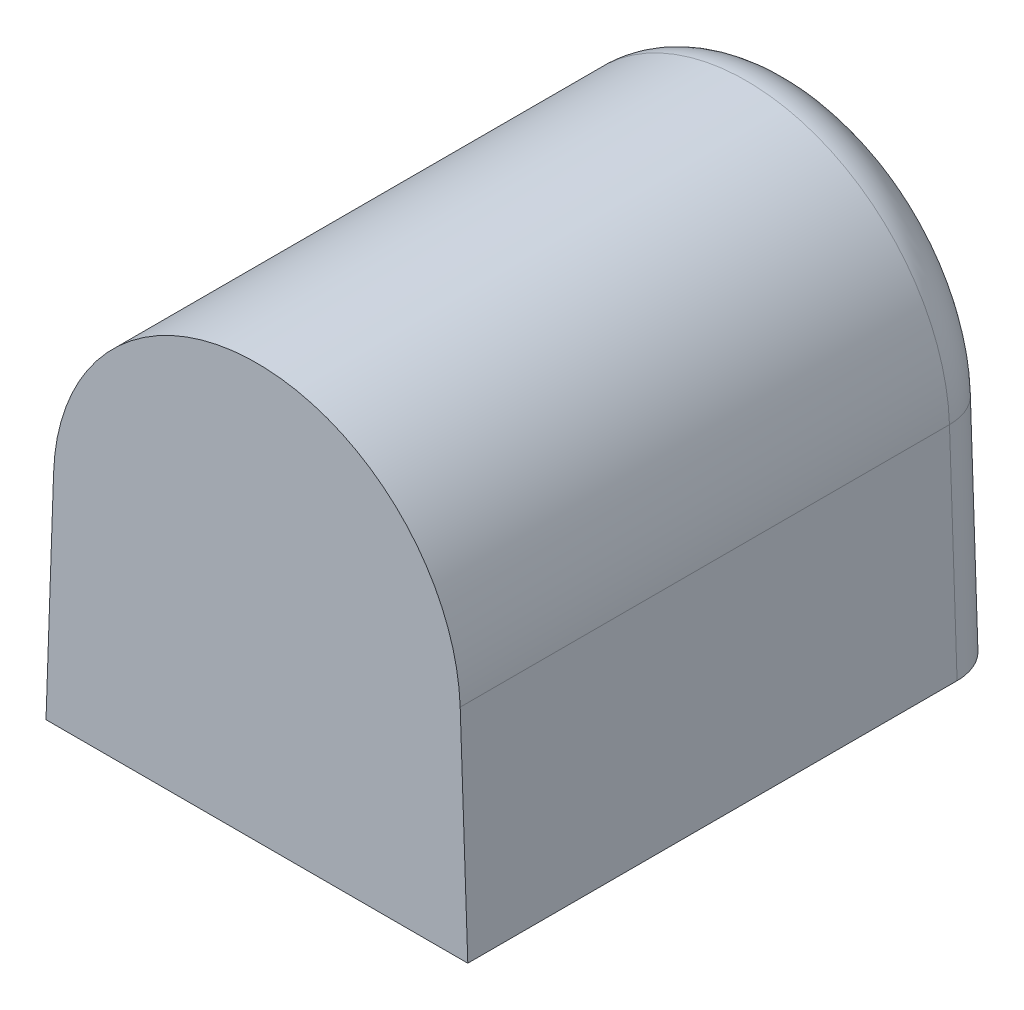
ISO-10303-21;
HEADER;
FILE_DESCRIPTION(('STEP AP214'),'2;1');
FILE_NAME('part.step','',(''),(''),'','','');
FILE_SCHEMA(('AUTOMOTIVE_DESIGN { 1 0 10303 214 1 1 1 1 }'));
ENDSEC;
DATA;
#1=APPLICATION_CONTEXT('core data for automotive mechanical design processes');
#2=APPLICATION_PROTOCOL_DEFINITION('international standard','automotive_design',2000,#1);
#3=PRODUCT_CONTEXT('',#1,'mechanical');
#4=PRODUCT('Part','Part','',(#3));
#5=PRODUCT_RELATED_PRODUCT_CATEGORY('part','',(#4));
#6=PRODUCT_DEFINITION_FORMATION('','',#4);
#7=PRODUCT_DEFINITION_CONTEXT('part definition',#1,'design');
#8=PRODUCT_DEFINITION('design','',#6,#7);
#9=PRODUCT_DEFINITION_SHAPE('','',#8);
#10=(LENGTH_UNIT() NAMED_UNIT(*) SI_UNIT(.MILLI.,.METRE.));
#11=(NAMED_UNIT(*) PLANE_ANGLE_UNIT() SI_UNIT($,.RADIAN.));
#12=(NAMED_UNIT(*) SI_UNIT($,.STERADIAN.) SOLID_ANGLE_UNIT());
#13=UNCERTAINTY_MEASURE_WITH_UNIT(LENGTH_MEASURE(1.E-05),#10,'distance_accuracy_value','');
#14=(GEOMETRIC_REPRESENTATION_CONTEXT(3) GLOBAL_UNCERTAINTY_ASSIGNED_CONTEXT((#13)) GLOBAL_UNIT_ASSIGNED_CONTEXT((#10,
#11,#12)) REPRESENTATION_CONTEXT('',''));
#15=CARTESIAN_POINT('',(0.,0.,0.));
#16=DIRECTION('',(0.,0.,1.));
#17=DIRECTION('',(1.,0.,0.));
#18=AXIS2_PLACEMENT_3D('',#15,#16,#17);
#19=CARTESIAN_POINT('',(12.5,0.,-32.));
#20=DIRECTION('',(0.999390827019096,0.0348994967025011,0.));
#21=DIRECTION('',(-0.0348994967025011,0.999390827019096,0.));
#22=AXIS2_PLACEMENT_3D('',#19,#20,#21);
#23=PLANE('',#22);
#24=DIRECTION('',(0.,0.,1.));
#25=VECTOR('',#24,1.);
#26=CARTESIAN_POINT('',(12.5,0.,-32.));
#27=LINE('',#26,#25);
#28=CARTESIAN_POINT('',(12.5,0.,-29.));
#29=VERTEX_POINT('',#28);
#30=CARTESIAN_POINT('',(12.5,0.,0.));
#31=VERTEX_POINT('',#30);
#32=EDGE_CURVE('E114',#29,#31,#27,.T.);
#33=ORIENTED_EDGE('',*,*,#32,.F.);
#34=DIRECTION('',(-0.0348994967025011,0.999390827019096,0.));
#35=VECTOR('',#34,1.);
#36=CARTESIAN_POINT('',(12.5,0.,-29.));
#37=LINE('',#36,#35);
#38=CARTESIAN_POINT('',(12.0487973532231,12.9207532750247,-29.));
#39=VERTEX_POINT('',#38);
#40=EDGE_CURVE('E92',#29,#39,#37,.T.);
#41=ORIENTED_EDGE('',*,*,#40,.T.);
#42=DIRECTION('',(0.,0.,1.));
#43=VECTOR('',#42,1.);
#44=CARTESIAN_POINT('',(12.0487973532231,12.9207532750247,-32.));
#45=LINE('',#44,#43);
#46=CARTESIAN_POINT('',(12.0487973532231,12.9207532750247,0.));
#47=VERTEX_POINT('',#46);
#48=EDGE_CURVE('E85',#39,#47,#45,.T.);
#49=ORIENTED_EDGE('',*,*,#48,.T.);
#50=DIRECTION('',(-0.0348994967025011,0.999390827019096,0.));
#51=VECTOR('',#50,1.);
#52=CARTESIAN_POINT('',(12.5,0.,0.));
#53=LINE('',#52,#51);
#54=EDGE_CURVE('E89',#31,#47,#53,.T.);
#55=ORIENTED_EDGE('',*,*,#54,.F.);
#56=EDGE_LOOP('',(#33,#41,#49,#55));
#57=FACE_BOUND('',#56,.T.);
#58=ADVANCED_FACE('F32',(#57),#23,.T.);
#59=CARTESIAN_POINT('',(-12.5,0.,-32.));
#60=DIRECTION('',(0.,-1.,0.));
#61=DIRECTION('',(0.,0.,-1.));
#62=AXIS2_PLACEMENT_3D('',#59,#60,#61);
#63=PLANE('',#62);
#64=DIRECTION('',(1.,0.,0.));
#65=VECTOR('',#64,1.);
#66=CARTESIAN_POINT('',(-12.5,0.,-32.));
#67=LINE('',#66,#65);
#68=CARTESIAN_POINT('',(-9.49817136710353,0.,-32.));
#69=VERTEX_POINT('',#68);
#70=CARTESIAN_POINT('',(9.49817136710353,0.,-32.));
#71=VERTEX_POINT('',#70);
#72=EDGE_CURVE('E94',#69,#71,#67,.T.);
#73=ORIENTED_EDGE('',*,*,#72,.T.);
#74=CARTESIAN_POINT('',(9.49817136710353,0.,-29.));
#75=DIRECTION('',(0.,-1.,0.));
#76=DIRECTION('',(-1.,0.,0.));
#77=AXIS2_PLACEMENT_3D('',#74,#75,#76);
#78=ELLIPSE('',#77,3.00182863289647,3.);
#79=EDGE_CURVE('E128',#71,#29,#78,.T.);
#80=ORIENTED_EDGE('',*,*,#79,.T.);
#81=ORIENTED_EDGE('',*,*,#32,.T.);
#82=DIRECTION('',(1.,0.,0.));
#83=VECTOR('',#82,1.);
#84=CARTESIAN_POINT('',(-12.5,0.,0.));
#85=LINE('',#84,#83);
#86=CARTESIAN_POINT('',(-12.5,0.,0.));
#87=VERTEX_POINT('',#86);
#88=EDGE_CURVE('E106',#87,#31,#85,.T.);
#89=ORIENTED_EDGE('',*,*,#88,.F.);
#90=DIRECTION('',(0.,0.,1.));
#91=VECTOR('',#90,1.);
#92=CARTESIAN_POINT('',(-12.5,0.,-32.));
#93=LINE('',#92,#91);
#94=CARTESIAN_POINT('',(-12.5,0.,-29.));
#95=VERTEX_POINT('',#94);
#96=EDGE_CURVE('E116',#95,#87,#93,.T.);
#97=ORIENTED_EDGE('',*,*,#96,.F.);
#98=CARTESIAN_POINT('',(-9.49817136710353,0.,-29.));
#99=DIRECTION('',(0.,-1.,0.));
#100=DIRECTION('',(-1.,0.,0.));
#101=AXIS2_PLACEMENT_3D('',#98,#99,#100);
#102=ELLIPSE('',#101,3.00182863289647,3.);
#103=EDGE_CURVE('E126',#95,#69,#102,.T.);
#104=ORIENTED_EDGE('',*,*,#103,.T.);
#105=EDGE_LOOP('',(#73,#80,#81,#89,#97,#104));
#106=FACE_BOUND('',#105,.T.);
#107=ADVANCED_FACE('F145',(#106),#63,.T.);
#108=CARTESIAN_POINT('',(-12.5,0.,-32.));
#109=DIRECTION('',(-0.999390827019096,0.0348994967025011,0.));
#110=DIRECTION('',(-0.0348994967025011,-0.999390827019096,0.));
#111=AXIS2_PLACEMENT_3D('',#108,#109,#110);
#112=PLANE('',#111);
#113=DIRECTION('',(0.,0.,1.));
#114=VECTOR('',#113,1.);
#115=CARTESIAN_POINT('',(-12.0487973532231,12.9207532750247,-32.));
#116=LINE('',#115,#114);
#117=CARTESIAN_POINT('',(-12.0487973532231,12.9207532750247,-29.));
#118=VERTEX_POINT('',#117);
#119=CARTESIAN_POINT('',(-12.0487973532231,12.9207532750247,0.));
#120=VERTEX_POINT('',#119);
#121=EDGE_CURVE('E93',#118,#120,#116,.T.);
#122=ORIENTED_EDGE('',*,*,#121,.F.);
#123=DIRECTION('',(-0.0348994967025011,-0.999390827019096,0.));
#124=VECTOR('',#123,1.);
#125=CARTESIAN_POINT('',(-12.5,0.,-29.));
#126=LINE('',#125,#124);
#127=EDGE_CURVE('E41',#118,#95,#126,.T.);
#128=ORIENTED_EDGE('',*,*,#127,.T.);
#129=ORIENTED_EDGE('',*,*,#96,.T.);
#130=DIRECTION('',(-0.0348994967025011,-0.999390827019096,0.));
#131=VECTOR('',#130,1.);
#132=CARTESIAN_POINT('',(-12.5,0.,0.));
#133=LINE('',#132,#131);
#134=EDGE_CURVE('E102',#120,#87,#133,.T.);
#135=ORIENTED_EDGE('',*,*,#134,.F.);
#136=EDGE_LOOP('',(#122,#128,#129,#135));
#137=FACE_BOUND('',#136,.T.);
#138=ADVANCED_FACE('F155',(#137),#112,.T.);
#139=CARTESIAN_POINT('',(0.,12.5,-32.));
#140=DIRECTION('',(0.,0.,1.));
#141=DIRECTION('',(1.,0.,0.));
#142=AXIS2_PLACEMENT_3D('',#139,#140,#141);
#143=CYLINDRICAL_SURFACE('',#142,12.0561416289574);
#144=ORIENTED_EDGE('',*,*,#48,.F.);
#145=CARTESIAN_POINT('',(0.,12.5,-29.));
#146=DIRECTION('',(0.,0.,-1.));
#147=DIRECTION('',(-1.,0.,0.));
#148=AXIS2_PLACEMENT_3D('',#145,#146,#147);
#149=CIRCLE('',#148,12.0561416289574);
#150=EDGE_CURVE('E11',#39,#118,#149,.F.);
#151=ORIENTED_EDGE('',*,*,#150,.T.);
#152=ORIENTED_EDGE('',*,*,#121,.T.);
#153=CARTESIAN_POINT('',(0.,12.5,0.));
#154=DIRECTION('',(0.,0.,1.));
#155=DIRECTION('',(-1.,0.,0.));
#156=AXIS2_PLACEMENT_3D('',#153,#154,#155);
#157=CIRCLE('',#156,12.0561416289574);
#158=EDGE_CURVE('E97',#47,#120,#157,.T.);
#159=ORIENTED_EDGE('',*,*,#158,.F.);
#160=EDGE_LOOP('',(#144,#151,#152,#159));
#161=FACE_BOUND('',#160,.T.);
#162=ADVANCED_FACE('F98',(#161),#143,.T.);
#163=CARTESIAN_POINT('',(0.,12.5,-32.));
#164=DIRECTION('',(0.,0.,-1.));
#165=DIRECTION('',(-1.,0.,0.));
#166=AXIS2_PLACEMENT_3D('',#163,#164,#165);
#167=PLANE('',#166);
#168=CARTESIAN_POINT('',(0.,12.5,-32.));
#169=DIRECTION('',(0.,0.,-1.));
#170=DIRECTION('',(-1.,0.,0.));
#171=AXIS2_PLACEMENT_3D('',#168,#169,#170);
#172=CIRCLE('',#171,9.05614162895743);
#173=CARTESIAN_POINT('',(-9.05062487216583,12.8160547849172,-32.));
#174=VERTEX_POINT('',#173);
#175=CARTESIAN_POINT('',(9.05062487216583,12.8160547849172,-32.));
#176=VERTEX_POINT('',#175);
#177=EDGE_CURVE('E120',#174,#176,#172,.T.);
#178=ORIENTED_EDGE('',*,*,#177,.T.);
#179=DIRECTION('',(-0.0348994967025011,0.999390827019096,0.));
#180=VECTOR('',#179,1.);
#181=CARTESIAN_POINT('',(9.05062487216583,12.8160547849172,-32.));
#182=LINE('',#181,#180);
#183=EDGE_CURVE('E124',#176,#71,#182,.F.);
#184=ORIENTED_EDGE('',*,*,#183,.T.);
#185=ORIENTED_EDGE('',*,*,#72,.F.);
#186=DIRECTION('',(-0.0348994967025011,-0.999390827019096,0.));
#187=VECTOR('',#186,1.);
#188=CARTESIAN_POINT('',(-9.05062487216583,12.8160547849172,-32.));
#189=LINE('',#188,#187);
#190=EDGE_CURVE('E122',#69,#174,#189,.F.);
#191=ORIENTED_EDGE('',*,*,#190,.T.);
#192=EDGE_LOOP('',(#178,#184,#185,#191));
#193=FACE_BOUND('',#192,.T.);
#194=ADVANCED_FACE('F147',(#193),#167,.T.);
#195=CARTESIAN_POINT('',(0.,12.5,0.));
#196=DIRECTION('',(0.,0.,-1.));
#197=DIRECTION('',(-1.,0.,0.));
#198=AXIS2_PLACEMENT_3D('',#195,#196,#197);
#199=PLANE('',#198);
#200=ORIENTED_EDGE('',*,*,#54,.T.);
#201=ORIENTED_EDGE('',*,*,#158,.T.);
#202=ORIENTED_EDGE('',*,*,#134,.T.);
#203=ORIENTED_EDGE('',*,*,#88,.T.);
#204=EDGE_LOOP('',(#200,#201,#202,#203));
#205=FACE_BOUND('',#204,.T.);
#206=ADVANCED_FACE('F104',(#205),#199,.F.);
#207=CARTESIAN_POINT('',(-9.50182751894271,-0.104698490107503,-29.));
#208=DIRECTION('',(-0.0348994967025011,-0.999390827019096,0.));
#209=DIRECTION('',(0.999390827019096,-0.0348994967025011,0.));
#210=AXIS2_PLACEMENT_3D('',#207,#208,#209);
#211=CYLINDRICAL_SURFACE('',#210,3.);
#212=ORIENTED_EDGE('',*,*,#103,.F.);
#213=ORIENTED_EDGE('',*,*,#127,.F.);
#214=CARTESIAN_POINT('',(-9.05062487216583,12.8160547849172,-29.));
#215=DIRECTION('',(0.0348994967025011,0.999390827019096,0.));
#216=DIRECTION('',(-0.999390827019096,0.0348994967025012,0.));
#217=AXIS2_PLACEMENT_3D('',#214,#215,#216);
#218=CIRCLE('',#217,3.);
#219=EDGE_CURVE('E36',#174,#118,#218,.T.);
#220=ORIENTED_EDGE('',*,*,#219,.F.);
#221=ORIENTED_EDGE('',*,*,#190,.F.);
#222=EDGE_LOOP('',(#212,#213,#220,#221));
#223=FACE_BOUND('',#222,.T.);
#224=ADVANCED_FACE('F34',(#223),#211,.T.);
#225=CARTESIAN_POINT('',(0.,12.5,-29.));
#226=DIRECTION('',(0.,0.,-1.));
#227=DIRECTION('',(-1.,0.,0.));
#228=AXIS2_PLACEMENT_3D('',#225,#226,#227);
#229=TOROIDAL_SURFACE('',#228,9.05614162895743,3.);
#230=ORIENTED_EDGE('',*,*,#219,.T.);
#231=ORIENTED_EDGE('',*,*,#150,.F.);
#232=CARTESIAN_POINT('',(9.05062487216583,12.8160547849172,-29.));
#233=DIRECTION('',(0.0348994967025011,-0.999390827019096,0.));
#234=DIRECTION('',(0.999390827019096,0.0348994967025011,0.));
#235=AXIS2_PLACEMENT_3D('',#232,#233,#234);
#236=CIRCLE('',#235,3.);
#237=EDGE_CURVE('E109',#176,#39,#236,.T.);
#238=ORIENTED_EDGE('',*,*,#237,.F.);
#239=ORIENTED_EDGE('',*,*,#177,.F.);
#240=EDGE_LOOP('',(#230,#231,#238,#239));
#241=FACE_BOUND('',#240,.T.);
#242=ADVANCED_FACE('F137',(#241),#229,.T.);
#243=CARTESIAN_POINT('',(9.50182751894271,-0.104698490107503,-29.));
#244=DIRECTION('',(-0.0348994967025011,0.999390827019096,0.));
#245=DIRECTION('',(-0.999390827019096,-0.0348994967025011,0.));
#246=AXIS2_PLACEMENT_3D('',#243,#244,#245);
#247=CYLINDRICAL_SURFACE('',#246,3.);
#248=ORIENTED_EDGE('',*,*,#79,.F.);
#249=ORIENTED_EDGE('',*,*,#183,.F.);
#250=ORIENTED_EDGE('',*,*,#237,.T.);
#251=ORIENTED_EDGE('',*,*,#40,.F.);
#252=EDGE_LOOP('',(#248,#249,#250,#251));
#253=FACE_BOUND('',#252,.T.);
#254=ADVANCED_FACE('F134',(#253),#247,.T.);
#255=CLOSED_SHELL('',(#58,#107,#138,#162,#194,#206,#224,#242,#254));
#256=MANIFOLD_SOLID_BREP('B2',#255);
#257=ADVANCED_BREP_SHAPE_REPRESENTATION('',(#18,#256),#14);
#258=SHAPE_DEFINITION_REPRESENTATION(#9,#257);
ENDSEC;
END-ISO-10303-21;
